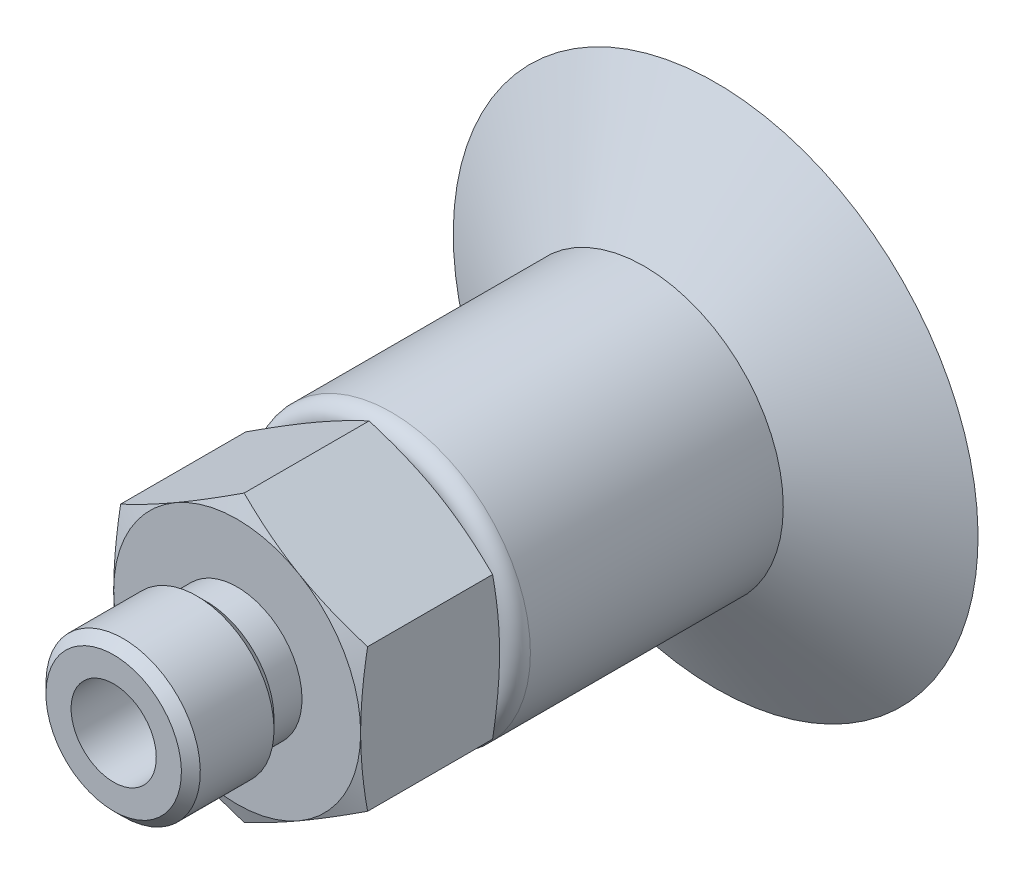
ISO-10303-21;
HEADER;
FILE_DESCRIPTION(('STEP AP214'),'2;1');
FILE_NAME('part.step','',(''),(''),'','','');
FILE_SCHEMA(('AUTOMOTIVE_DESIGN { 1 0 10303 214 1 1 1 1 }'));
ENDSEC;
DATA;
#1=APPLICATION_CONTEXT('core data for automotive mechanical design processes');
#2=APPLICATION_PROTOCOL_DEFINITION('international standard','automotive_design',2000,#1);
#3=PRODUCT_CONTEXT('',#1,'mechanical');
#4=PRODUCT('Part','Part','',(#3));
#5=PRODUCT_RELATED_PRODUCT_CATEGORY('part','',(#4));
#6=PRODUCT_DEFINITION_FORMATION('','',#4);
#7=PRODUCT_DEFINITION_CONTEXT('part definition',#1,'design');
#8=PRODUCT_DEFINITION('design','',#6,#7);
#9=PRODUCT_DEFINITION_SHAPE('','',#8);
#10=(LENGTH_UNIT() NAMED_UNIT(*) SI_UNIT(.MILLI.,.METRE.));
#11=(NAMED_UNIT(*) PLANE_ANGLE_UNIT() SI_UNIT($,.RADIAN.));
#12=(NAMED_UNIT(*) SI_UNIT($,.STERADIAN.) SOLID_ANGLE_UNIT());
#13=UNCERTAINTY_MEASURE_WITH_UNIT(LENGTH_MEASURE(1.E-05),#10,'distance_accuracy_value','');
#14=(GEOMETRIC_REPRESENTATION_CONTEXT(3) GLOBAL_UNCERTAINTY_ASSIGNED_CONTEXT((#13)) GLOBAL_UNIT_ASSIGNED_CONTEXT((#10,
#11,#12)) REPRESENTATION_CONTEXT('',''));
#15=CARTESIAN_POINT('',(0.,0.,0.));
#16=DIRECTION('',(0.,0.,1.));
#17=DIRECTION('',(1.,0.,0.));
#18=AXIS2_PLACEMENT_3D('',#15,#16,#17);
#19=CARTESIAN_POINT('',(4.,2.3094010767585,15.5));
#20=DIRECTION('',(-0.5,-0.866025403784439,0.));
#21=DIRECTION('',(0.,0.,-1.));
#22=AXIS2_PLACEMENT_3D('',#19,#20,#21);
#23=PLANE('',#22);
#24=CARTESIAN_POINT('',(4.,2.3094010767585,11.22522556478));
#25=CARTESIAN_POINT('',(2.92820323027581,2.92820323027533,11.));
#26=CARTESIAN_POINT('',(2.,3.46410161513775,11.));
#27=B_SPLINE_CURVE_WITH_KNOTS('',2,(#24,#25,#26),.UNSPECIFIED.,.F.,.F.,(3,3),(0.,1.),.UNSPECIFIED.);
#28=CARTESIAN_POINT('',(4.,2.3094010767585,11.22522556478));
#29=VERTEX_POINT('',#28);
#30=CARTESIAN_POINT('',(2.,3.46410161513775,11.));
#31=VERTEX_POINT('',#30);
#32=EDGE_CURVE('E599',#29,#31,#27,.T.);
#33=ORIENTED_EDGE('',*,*,#32,.T.);
#34=CARTESIAN_POINT('',(2.,3.46410161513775,11.));
#35=CARTESIAN_POINT('',(1.07179676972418,4.00000000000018,11.));
#36=CARTESIAN_POINT('',(0.,4.618802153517,11.22522556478));
#37=B_SPLINE_CURVE_WITH_KNOTS('',2,(#34,#35,#36),.UNSPECIFIED.,.F.,.F.,(3,3),(0.,1.),.UNSPECIFIED.);
#38=CARTESIAN_POINT('',(0.,4.61880215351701,11.22522556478));
#39=VERTEX_POINT('',#38);
#40=EDGE_CURVE('E650',#31,#39,#37,.T.);
#41=ORIENTED_EDGE('',*,*,#40,.T.);
#42=DIRECTION('',(0.,0.,-1.));
#43=VECTOR('',#42,1.);
#44=CARTESIAN_POINT('',(0.,4.61880215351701,15.5));
#45=LINE('',#44,#43);
#46=CARTESIAN_POINT('',(0.,4.61880215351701,15.27477443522));
#47=VERTEX_POINT('',#46);
#48=EDGE_CURVE('E10',#47,#39,#45,.T.);
#49=ORIENTED_EDGE('',*,*,#48,.F.);
#50=CARTESIAN_POINT('',(0.,4.618802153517,15.27477443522));
#51=CARTESIAN_POINT('',(1.07179676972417,4.00000000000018,15.5));
#52=CARTESIAN_POINT('',(1.99999999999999,3.46410161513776,15.5));
#53=B_SPLINE_CURVE_WITH_KNOTS('',2,(#50,#51,#52),.UNSPECIFIED.,.F.,.F.,(3,3),(0.,1.),.UNSPECIFIED.);
#54=CARTESIAN_POINT('',(2.,3.46410161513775,15.5));
#55=VERTEX_POINT('',#54);
#56=EDGE_CURVE('E86',#47,#55,#53,.T.);
#57=ORIENTED_EDGE('',*,*,#56,.T.);
#58=CARTESIAN_POINT('',(2.,3.46410161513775,15.5));
#59=CARTESIAN_POINT('',(2.92820323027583,2.92820323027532,15.5));
#60=CARTESIAN_POINT('',(4.,2.3094010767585,15.27477443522));
#61=B_SPLINE_CURVE_WITH_KNOTS('',2,(#58,#59,#60),.UNSPECIFIED.,.F.,.F.,(3,3),(0.,1.),.UNSPECIFIED.);
#62=CARTESIAN_POINT('',(4.,2.3094010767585,15.27477443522));
#63=VERTEX_POINT('',#62);
#64=EDGE_CURVE('E789',#55,#63,#61,.T.);
#65=ORIENTED_EDGE('',*,*,#64,.T.);
#66=DIRECTION('',(0.,0.,-1.));
#67=VECTOR('',#66,1.);
#68=CARTESIAN_POINT('',(4.,2.3094010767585,15.5));
#69=LINE('',#68,#67);
#70=EDGE_CURVE('E653',#63,#29,#69,.T.);
#71=ORIENTED_EDGE('',*,*,#70,.T.);
#72=EDGE_LOOP('',(#33,#41,#49,#57,#65,#71));
#73=FACE_BOUND('',#72,.T.);
#74=ADVANCED_FACE('F15',(#73),#23,.F.);
#75=CARTESIAN_POINT('',(0.,4.61880215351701,15.5));
#76=DIRECTION('',(0.5,-0.866025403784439,0.));
#77=DIRECTION('',(0.866025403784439,0.5,0.));
#78=AXIS2_PLACEMENT_3D('',#75,#76,#77);
#79=PLANE('',#78);
#80=CARTESIAN_POINT('',(0.,4.61880215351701,11.22522556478));
#81=CARTESIAN_POINT('',(-1.07179676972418,4.00000000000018,11.));
#82=CARTESIAN_POINT('',(-2.,3.46410161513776,11.));
#83=B_SPLINE_CURVE_WITH_KNOTS('',2,(#80,#81,#82),.UNSPECIFIED.,.F.,.F.,(3,3),(0.,1.),.UNSPECIFIED.);
#84=CARTESIAN_POINT('',(-2.,3.46410161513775,11.));
#85=VERTEX_POINT('',#84);
#86=EDGE_CURVE('E641',#39,#85,#83,.T.);
#87=ORIENTED_EDGE('',*,*,#86,.T.);
#88=CARTESIAN_POINT('',(-2.,3.46410161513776,11.));
#89=CARTESIAN_POINT('',(-2.92820323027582,2.92820323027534,11.));
#90=CARTESIAN_POINT('',(-4.,2.3094010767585,11.22522556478));
#91=B_SPLINE_CURVE_WITH_KNOTS('',2,(#88,#89,#90),.UNSPECIFIED.,.F.,.F.,(3,3),(0.,1.),.UNSPECIFIED.);
#92=CARTESIAN_POINT('',(-4.,2.3094010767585,11.22522556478));
#93=VERTEX_POINT('',#92);
#94=EDGE_CURVE('E412',#85,#93,#91,.T.);
#95=ORIENTED_EDGE('',*,*,#94,.T.);
#96=DIRECTION('',(0.,0.,-1.));
#97=VECTOR('',#96,1.);
#98=CARTESIAN_POINT('',(-4.,2.3094010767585,15.5));
#99=LINE('',#98,#97);
#100=CARTESIAN_POINT('',(-4.,2.3094010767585,15.27477443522));
#101=VERTEX_POINT('',#100);
#102=EDGE_CURVE('E28',#101,#93,#99,.T.);
#103=ORIENTED_EDGE('',*,*,#102,.F.);
#104=CARTESIAN_POINT('',(-4.,2.3094010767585,15.27477443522));
#105=CARTESIAN_POINT('',(-2.92820323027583,2.92820323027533,15.5));
#106=CARTESIAN_POINT('',(-2.,3.46410161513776,15.5));
#107=B_SPLINE_CURVE_WITH_KNOTS('',2,(#104,#105,#106),.UNSPECIFIED.,.F.,.F.,(3,3),(0.,1.),.UNSPECIFIED.);
#108=CARTESIAN_POINT('',(-2.,3.46410161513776,15.5));
#109=VERTEX_POINT('',#108);
#110=EDGE_CURVE('E463',#101,#109,#107,.T.);
#111=ORIENTED_EDGE('',*,*,#110,.T.);
#112=CARTESIAN_POINT('',(-2.,3.46410161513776,15.5));
#113=CARTESIAN_POINT('',(-1.07179676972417,4.00000000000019,15.5));
#114=CARTESIAN_POINT('',(0.,4.61880215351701,15.27477443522));
#115=B_SPLINE_CURVE_WITH_KNOTS('',2,(#112,#113,#114),.UNSPECIFIED.,.F.,.F.,(3,3),(0.,1.),.UNSPECIFIED.);
#116=EDGE_CURVE('E796',#109,#47,#115,.T.);
#117=ORIENTED_EDGE('',*,*,#116,.T.);
#118=ORIENTED_EDGE('',*,*,#48,.T.);
#119=EDGE_LOOP('',(#87,#95,#103,#111,#117,#118));
#120=FACE_BOUND('',#119,.T.);
#121=ADVANCED_FACE('F419',(#120),#79,.F.);
#122=CARTESIAN_POINT('',(-4.,2.3094010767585,15.5));
#123=DIRECTION('',(1.,0.,0.));
#124=DIRECTION('',(0.,1.,0.));
#125=AXIS2_PLACEMENT_3D('',#122,#123,#124);
#126=PLANE('',#125);
#127=CARTESIAN_POINT('',(-4.,2.3094010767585,11.22522556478));
#128=CARTESIAN_POINT('',(-4.,1.07179676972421,11.));
#129=CARTESIAN_POINT('',(-4.,0.,11.));
#130=B_SPLINE_CURVE_WITH_KNOTS('',2,(#127,#128,#129),.UNSPECIFIED.,.F.,.F.,(3,3),(0.,1.),.UNSPECIFIED.);
#131=CARTESIAN_POINT('',(-4.,0.,11.));
#132=VERTEX_POINT('',#131);
#133=EDGE_CURVE('E398',#93,#132,#130,.T.);
#134=ORIENTED_EDGE('',*,*,#133,.T.);
#135=CARTESIAN_POINT('',(-4.,0.,11.));
#136=CARTESIAN_POINT('',(-4.,-1.07179676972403,11.));
#137=CARTESIAN_POINT('',(-4.,-2.3094010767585,11.22522556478));
#138=B_SPLINE_CURVE_WITH_KNOTS('',2,(#135,#136,#137),.UNSPECIFIED.,.F.,.F.,(3,3),(0.,1.),.UNSPECIFIED.);
#139=CARTESIAN_POINT('',(-4.,-2.3094010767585,11.22522556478));
#140=VERTEX_POINT('',#139);
#141=EDGE_CURVE('E554',#132,#140,#138,.T.);
#142=ORIENTED_EDGE('',*,*,#141,.T.);
#143=DIRECTION('',(0.,0.,-1.));
#144=VECTOR('',#143,1.);
#145=CARTESIAN_POINT('',(-4.,-2.3094010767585,15.5));
#146=LINE('',#145,#144);
#147=CARTESIAN_POINT('',(-4.,-2.3094010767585,15.27477443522));
#148=VERTEX_POINT('',#147);
#149=EDGE_CURVE('E211',#148,#140,#146,.T.);
#150=ORIENTED_EDGE('',*,*,#149,.F.);
#151=CARTESIAN_POINT('',(-4.,-2.3094010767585,15.27477443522));
#152=CARTESIAN_POINT('',(-4.,-1.0717967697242,15.5));
#153=CARTESIAN_POINT('',(-4.,0.,15.5));
#154=B_SPLINE_CURVE_WITH_KNOTS('',2,(#151,#152,#153),.UNSPECIFIED.,.F.,.F.,(3,3),(0.,1.),.UNSPECIFIED.);
#155=CARTESIAN_POINT('',(-4.,0.,15.5));
#156=VERTEX_POINT('',#155);
#157=EDGE_CURVE('E500',#148,#156,#154,.T.);
#158=ORIENTED_EDGE('',*,*,#157,.T.);
#159=CARTESIAN_POINT('',(-4.,0.,15.5));
#160=CARTESIAN_POINT('',(-4.,1.07179676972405,15.5));
#161=CARTESIAN_POINT('',(-4.,2.3094010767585,15.27477443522));
#162=B_SPLINE_CURVE_WITH_KNOTS('',2,(#159,#160,#161),.UNSPECIFIED.,.F.,.F.,(3,3),(0.,1.),.UNSPECIFIED.);
#163=EDGE_CURVE('E703',#156,#101,#162,.T.);
#164=ORIENTED_EDGE('',*,*,#163,.T.);
#165=ORIENTED_EDGE('',*,*,#102,.T.);
#166=EDGE_LOOP('',(#134,#142,#150,#158,#164,#165));
#167=FACE_BOUND('',#166,.T.);
#168=ADVANCED_FACE('F248',(#167),#126,.F.);
#169=CARTESIAN_POINT('',(-4.,-2.3094010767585,15.5));
#170=DIRECTION('',(0.5,0.866025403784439,0.));
#171=DIRECTION('',(0.,0.,1.));
#172=AXIS2_PLACEMENT_3D('',#169,#170,#171);
#173=PLANE('',#172);
#174=CARTESIAN_POINT('',(-4.,-2.3094010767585,11.22522556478));
#175=CARTESIAN_POINT('',(-2.92820323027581,-2.92820323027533,11.));
#176=CARTESIAN_POINT('',(-2.,-3.46410161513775,11.));
#177=B_SPLINE_CURVE_WITH_KNOTS('',2,(#174,#175,#176),.UNSPECIFIED.,.F.,.F.,(3,3),(0.,1.),.UNSPECIFIED.);
#178=CARTESIAN_POINT('',(-2.,-3.46410161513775,11.));
#179=VERTEX_POINT('',#178);
#180=EDGE_CURVE('E229',#140,#179,#177,.T.);
#181=ORIENTED_EDGE('',*,*,#180,.T.);
#182=CARTESIAN_POINT('',(-2.,-3.46410161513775,11.));
#183=CARTESIAN_POINT('',(-1.07179676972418,-4.00000000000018,11.));
#184=CARTESIAN_POINT('',(0.,-4.618802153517,11.22522556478));
#185=B_SPLINE_CURVE_WITH_KNOTS('',2,(#182,#183,#184),.UNSPECIFIED.,.F.,.F.,(3,3),(0.,1.),.UNSPECIFIED.);
#186=CARTESIAN_POINT('',(0.,-4.61880215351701,11.22522556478));
#187=VERTEX_POINT('',#186);
#188=EDGE_CURVE('E217',#179,#187,#185,.T.);
#189=ORIENTED_EDGE('',*,*,#188,.T.);
#190=DIRECTION('',(0.,0.,-1.));
#191=VECTOR('',#190,1.);
#192=CARTESIAN_POINT('',(0.,-4.61880215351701,15.5));
#193=LINE('',#192,#191);
#194=CARTESIAN_POINT('',(0.,-4.61880215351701,15.27477443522));
#195=VERTEX_POINT('',#194);
#196=EDGE_CURVE('E197',#195,#187,#193,.T.);
#197=ORIENTED_EDGE('',*,*,#196,.F.);
#198=CARTESIAN_POINT('',(0.,-4.618802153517,15.27477443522));
#199=CARTESIAN_POINT('',(-1.07179676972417,-4.00000000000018,15.5));
#200=CARTESIAN_POINT('',(-2.,-3.46410161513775,15.5));
#201=B_SPLINE_CURVE_WITH_KNOTS('',2,(#198,#199,#200),.UNSPECIFIED.,.F.,.F.,(3,3),(0.,1.),.UNSPECIFIED.);
#202=CARTESIAN_POINT('',(-2.,-3.46410161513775,15.5));
#203=VERTEX_POINT('',#202);
#204=EDGE_CURVE('E275',#195,#203,#201,.T.);
#205=ORIENTED_EDGE('',*,*,#204,.T.);
#206=CARTESIAN_POINT('',(-2.,-3.46410161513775,15.5));
#207=CARTESIAN_POINT('',(-2.92820323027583,-2.92820323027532,15.5));
#208=CARTESIAN_POINT('',(-4.,-2.3094010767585,15.27477443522));
#209=B_SPLINE_CURVE_WITH_KNOTS('',2,(#206,#207,#208),.UNSPECIFIED.,.F.,.F.,(3,3),(0.,1.),.UNSPECIFIED.);
#210=EDGE_CURVE('E501',#203,#148,#209,.T.);
#211=ORIENTED_EDGE('',*,*,#210,.T.);
#212=ORIENTED_EDGE('',*,*,#149,.T.);
#213=EDGE_LOOP('',(#181,#189,#197,#205,#211,#212));
#214=FACE_BOUND('',#213,.T.);
#215=ADVANCED_FACE('F227',(#214),#173,.F.);
#216=CARTESIAN_POINT('',(0.,-4.61880215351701,15.5));
#217=DIRECTION('',(-0.5,0.866025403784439,0.));
#218=DIRECTION('',(0.,0.,-1.));
#219=AXIS2_PLACEMENT_3D('',#216,#217,#218);
#220=PLANE('',#219);
#221=CARTESIAN_POINT('',(0.,-4.61880215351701,11.22522556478));
#222=CARTESIAN_POINT('',(1.07179676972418,-4.00000000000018,11.));
#223=CARTESIAN_POINT('',(2.,-3.46410161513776,11.));
#224=B_SPLINE_CURVE_WITH_KNOTS('',2,(#221,#222,#223),.UNSPECIFIED.,.F.,.F.,(3,3),(0.,1.),.UNSPECIFIED.);
#225=CARTESIAN_POINT('',(2.,-3.46410161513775,11.));
#226=VERTEX_POINT('',#225);
#227=EDGE_CURVE('E200',#187,#226,#224,.T.);
#228=ORIENTED_EDGE('',*,*,#227,.T.);
#229=CARTESIAN_POINT('',(2.,-3.46410161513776,11.));
#230=CARTESIAN_POINT('',(2.92820323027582,-2.92820323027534,11.));
#231=CARTESIAN_POINT('',(4.,-2.3094010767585,11.22522556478));
#232=B_SPLINE_CURVE_WITH_KNOTS('',2,(#229,#230,#231),.UNSPECIFIED.,.F.,.F.,(3,3),(0.,1.),.UNSPECIFIED.);
#233=CARTESIAN_POINT('',(4.,-2.3094010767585,11.22522556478));
#234=VERTEX_POINT('',#233);
#235=EDGE_CURVE('E222',#226,#234,#232,.T.);
#236=ORIENTED_EDGE('',*,*,#235,.T.);
#237=DIRECTION('',(0.,0.,-1.));
#238=VECTOR('',#237,1.);
#239=CARTESIAN_POINT('',(4.,-2.3094010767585,15.5));
#240=LINE('',#239,#238);
#241=CARTESIAN_POINT('',(4.,-2.3094010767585,15.27477443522));
#242=VERTEX_POINT('',#241);
#243=EDGE_CURVE('E71',#242,#234,#240,.T.);
#244=ORIENTED_EDGE('',*,*,#243,.F.);
#245=CARTESIAN_POINT('',(4.,-2.3094010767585,15.27477443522));
#246=CARTESIAN_POINT('',(2.92820323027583,-2.92820323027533,15.5));
#247=CARTESIAN_POINT('',(2.,-3.46410161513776,15.5));
#248=B_SPLINE_CURVE_WITH_KNOTS('',2,(#245,#246,#247),.UNSPECIFIED.,.F.,.F.,(3,3),(0.,1.),.UNSPECIFIED.);
#249=CARTESIAN_POINT('',(2.,-3.46410161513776,15.5));
#250=VERTEX_POINT('',#249);
#251=EDGE_CURVE('E313',#242,#250,#248,.T.);
#252=ORIENTED_EDGE('',*,*,#251,.T.);
#253=CARTESIAN_POINT('',(2.,-3.46410161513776,15.5));
#254=CARTESIAN_POINT('',(1.07179676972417,-4.00000000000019,15.5));
#255=CARTESIAN_POINT('',(0.,-4.61880215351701,15.27477443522));
#256=B_SPLINE_CURVE_WITH_KNOTS('',2,(#253,#254,#255),.UNSPECIFIED.,.F.,.F.,(3,3),(0.,1.),.UNSPECIFIED.);
#257=EDGE_CURVE('E204',#250,#195,#256,.T.);
#258=ORIENTED_EDGE('',*,*,#257,.T.);
#259=ORIENTED_EDGE('',*,*,#196,.T.);
#260=EDGE_LOOP('',(#228,#236,#244,#252,#258,#259));
#261=FACE_BOUND('',#260,.T.);
#262=ADVANCED_FACE('F199',(#261),#220,.F.);
#263=CARTESIAN_POINT('',(4.,-2.3094010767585,15.5));
#264=DIRECTION('',(-1.,0.,0.));
#265=DIRECTION('',(0.,0.,1.));
#266=AXIS2_PLACEMENT_3D('',#263,#264,#265);
#267=PLANE('',#266);
#268=CARTESIAN_POINT('',(4.,-2.3094010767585,11.22522556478));
#269=CARTESIAN_POINT('',(4.,-1.07179676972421,11.));
#270=CARTESIAN_POINT('',(4.,0.,11.));
#271=B_SPLINE_CURVE_WITH_KNOTS('',2,(#268,#269,#270),.UNSPECIFIED.,.F.,.F.,(3,3),(0.,1.),.UNSPECIFIED.);
#272=CARTESIAN_POINT('',(4.,0.,11.));
#273=VERTEX_POINT('',#272);
#274=EDGE_CURVE('E391',#234,#273,#271,.T.);
#275=ORIENTED_EDGE('',*,*,#274,.T.);
#276=CARTESIAN_POINT('',(4.,0.,11.));
#277=CARTESIAN_POINT('',(4.,1.07179676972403,11.));
#278=CARTESIAN_POINT('',(4.,2.3094010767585,11.22522556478));
#279=B_SPLINE_CURVE_WITH_KNOTS('',2,(#276,#277,#278),.UNSPECIFIED.,.F.,.F.,(3,3),(0.,1.),.UNSPECIFIED.);
#280=EDGE_CURVE('E596',#273,#29,#279,.T.);
#281=ORIENTED_EDGE('',*,*,#280,.T.);
#282=ORIENTED_EDGE('',*,*,#70,.F.);
#283=CARTESIAN_POINT('',(4.,2.3094010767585,15.27477443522));
#284=CARTESIAN_POINT('',(4.,1.0717967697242,15.5));
#285=CARTESIAN_POINT('',(4.,0.,15.5));
#286=B_SPLINE_CURVE_WITH_KNOTS('',2,(#283,#284,#285),.UNSPECIFIED.,.F.,.F.,(3,3),(0.,1.),.UNSPECIFIED.);
#287=CARTESIAN_POINT('',(4.,0.,15.5));
#288=VERTEX_POINT('',#287);
#289=EDGE_CURVE('E655',#63,#288,#286,.T.);
#290=ORIENTED_EDGE('',*,*,#289,.T.);
#291=CARTESIAN_POINT('',(4.,0.,15.5));
#292=CARTESIAN_POINT('',(4.,-1.07179676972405,15.5));
#293=CARTESIAN_POINT('',(4.,-2.3094010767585,15.27477443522));
#294=B_SPLINE_CURVE_WITH_KNOTS('',2,(#291,#292,#293),.UNSPECIFIED.,.F.,.F.,(3,3),(0.,1.),.UNSPECIFIED.);
#295=EDGE_CURVE('E314',#288,#242,#294,.T.);
#296=ORIENTED_EDGE('',*,*,#295,.T.);
#297=ORIENTED_EDGE('',*,*,#243,.T.);
#298=EDGE_LOOP('',(#275,#281,#282,#290,#296,#297));
#299=FACE_BOUND('',#298,.T.);
#300=ADVANCED_FACE('F332',(#299),#267,.F.);
#301=CARTESIAN_POINT('',(-2.1935,0.,19.5));
#302=DIRECTION('',(0.,0.,1.));
#303=DIRECTION('',(-1.,0.,0.));
#304=AXIS2_PLACEMENT_3D('',#301,#302,#303);
#305=PLANE('',#304);
#306=CARTESIAN_POINT('',(0.,0.,19.5));
#307=DIRECTION('',(0.,0.,-1.));
#308=DIRECTION('',(0.,-1.,0.));
#309=AXIS2_PLACEMENT_3D('',#306,#307,#308);
#310=CIRCLE('',#309,2.1935);
#311=CARTESIAN_POINT('',(0.,-2.1935,19.5));
#312=VERTEX_POINT('',#311);
#313=EDGE_CURVE('E39',#312,#312,#310,.T.);
#314=ORIENTED_EDGE('',*,*,#313,.F.);
#315=EDGE_LOOP('',(#314));
#316=FACE_BOUND('',#315,.T.);
#317=CARTESIAN_POINT('',(0.,0.,19.5));
#318=DIRECTION('',(0.,0.,-1.));
#319=DIRECTION('',(0.,-1.,0.));
#320=AXIS2_PLACEMENT_3D('',#317,#318,#319);
#321=CIRCLE('',#320,1.38);
#322=CARTESIAN_POINT('',(0.,-1.38,19.5));
#323=VERTEX_POINT('',#322);
#324=EDGE_CURVE('E740',#323,#323,#321,.T.);
#325=ORIENTED_EDGE('',*,*,#324,.T.);
#326=EDGE_LOOP('',(#325));
#327=FACE_BOUND('',#326,.T.);
#328=ADVANCED_FACE('F570',(#316,#327),#305,.T.);
#329=CARTESIAN_POINT('',(0.,0.,19.1935));
#330=DIRECTION('',(0.,0.,-1.));
#331=DIRECTION('',(0.,-1.,0.));
#332=AXIS2_PLACEMENT_3D('',#329,#330,#331);
#333=CONICAL_SURFACE('',#332,2.5,0.785398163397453);
#334=CARTESIAN_POINT('',(0.,0.,19.1935));
#335=DIRECTION('',(0.,0.,-1.));
#336=DIRECTION('',(0.,-1.,0.));
#337=AXIS2_PLACEMENT_3D('',#334,#335,#336);
#338=CIRCLE('',#337,2.5);
#339=CARTESIAN_POINT('',(0.,-2.5,19.1935));
#340=VERTEX_POINT('',#339);
#341=EDGE_CURVE('E49',#340,#340,#338,.T.);
#342=ORIENTED_EDGE('',*,*,#341,.F.);
#343=EDGE_LOOP('',(#342));
#344=FACE_BOUND('',#343,.T.);
#345=ORIENTED_EDGE('',*,*,#313,.T.);
#346=EDGE_LOOP('',(#345));
#347=FACE_BOUND('',#346,.T.);
#348=ADVANCED_FACE('F837',(#344,#347),#333,.T.);
#349=CARTESIAN_POINT('',(0.,0.,0.));
#350=DIRECTION('',(0.,0.,-1.));
#351=DIRECTION('',(0.,-1.,0.));
#352=AXIS2_PLACEMENT_3D('',#349,#350,#351);
#353=CYLINDRICAL_SURFACE('',#352,2.5);
#354=CARTESIAN_POINT('',(0.,0.,16.8065));
#355=DIRECTION('',(0.,0.,-1.));
#356=DIRECTION('',(0.,-1.,0.));
#357=AXIS2_PLACEMENT_3D('',#354,#355,#356);
#358=CIRCLE('',#357,2.5);
#359=CARTESIAN_POINT('',(0.,-2.5,16.8065));
#360=VERTEX_POINT('',#359);
#361=EDGE_CURVE('E1286',#360,#360,#358,.T.);
#362=ORIENTED_EDGE('',*,*,#361,.F.);
#363=EDGE_LOOP('',(#362));
#364=FACE_BOUND('',#363,.T.);
#365=ORIENTED_EDGE('',*,*,#341,.T.);
#366=EDGE_LOOP('',(#365));
#367=FACE_BOUND('',#366,.T.);
#368=ADVANCED_FACE('F333',(#364,#367),#353,.T.);
#369=CARTESIAN_POINT('',(0.,0.,16.5));
#370=DIRECTION('',(0.,0.,1.));
#371=DIRECTION('',(0.,1.,0.));
#372=AXIS2_PLACEMENT_3D('',#369,#370,#371);
#373=CONICAL_SURFACE('',#372,2.1935,0.785398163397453);
#374=CARTESIAN_POINT('',(0.,0.,16.5));
#375=DIRECTION('',(0.,0.,-1.));
#376=DIRECTION('',(0.,-1.,0.));
#377=AXIS2_PLACEMENT_3D('',#374,#375,#376);
#378=CIRCLE('',#377,2.1935);
#379=CARTESIAN_POINT('',(0.,-2.1935,16.5));
#380=VERTEX_POINT('',#379);
#381=EDGE_CURVE('E730',#380,#380,#378,.T.);
#382=ORIENTED_EDGE('',*,*,#381,.F.);
#383=EDGE_LOOP('',(#382));
#384=FACE_BOUND('',#383,.T.);
#385=ORIENTED_EDGE('',*,*,#361,.T.);
#386=EDGE_LOOP('',(#385));
#387=FACE_BOUND('',#386,.T.);
#388=ADVANCED_FACE('F523',(#384,#387),#373,.T.);
#389=CARTESIAN_POINT('',(-2.1,0.,16.5));
#390=DIRECTION('',(0.,0.,-1.));
#391=DIRECTION('',(0.,-1.,0.));
#392=AXIS2_PLACEMENT_3D('',#389,#390,#391);
#393=PLANE('',#392);
#394=CARTESIAN_POINT('',(0.,0.,16.5));
#395=DIRECTION('',(0.,0.,-1.));
#396=DIRECTION('',(0.,-1.,0.));
#397=AXIS2_PLACEMENT_3D('',#394,#395,#396);
#398=CIRCLE('',#397,2.1);
#399=CARTESIAN_POINT('',(0.,-2.1,16.5));
#400=VERTEX_POINT('',#399);
#401=EDGE_CURVE('E727',#400,#400,#398,.T.);
#402=ORIENTED_EDGE('',*,*,#401,.F.);
#403=EDGE_LOOP('',(#402));
#404=FACE_BOUND('',#403,.T.);
#405=ORIENTED_EDGE('',*,*,#381,.T.);
#406=EDGE_LOOP('',(#405));
#407=FACE_BOUND('',#406,.T.);
#408=ADVANCED_FACE('F522',(#404,#407),#393,.T.);
#409=CARTESIAN_POINT('',(0.,0.,0.));
#410=DIRECTION('',(0.,0.,-1.));
#411=DIRECTION('',(0.,-1.,0.));
#412=AXIS2_PLACEMENT_3D('',#409,#410,#411);
#413=CYLINDRICAL_SURFACE('',#412,2.1);
#414=CARTESIAN_POINT('',(0.,0.,15.5));
#415=DIRECTION('',(0.,0.,-1.));
#416=DIRECTION('',(0.,-1.,0.));
#417=AXIS2_PLACEMENT_3D('',#414,#415,#416);
#418=CIRCLE('',#417,2.1);
#419=CARTESIAN_POINT('',(0.,-2.1,15.5));
#420=VERTEX_POINT('',#419);
#421=EDGE_CURVE('E731',#420,#420,#418,.T.);
#422=ORIENTED_EDGE('',*,*,#421,.F.);
#423=EDGE_LOOP('',(#422));
#424=FACE_BOUND('',#423,.T.);
#425=ORIENTED_EDGE('',*,*,#401,.T.);
#426=EDGE_LOOP('',(#425));
#427=FACE_BOUND('',#426,.T.);
#428=ADVANCED_FACE('F429',(#424,#427),#413,.T.);
#429=CARTESIAN_POINT('',(-4.,0.,15.5));
#430=DIRECTION('',(0.,0.,1.));
#431=DIRECTION('',(-1.,0.,0.));
#432=AXIS2_PLACEMENT_3D('',#429,#430,#431);
#433=PLANE('',#432);
#434=CARTESIAN_POINT('',(0.,0.,15.5));
#435=DIRECTION('',(0.,0.,-1.));
#436=DIRECTION('',(0.,-1.,0.));
#437=AXIS2_PLACEMENT_3D('',#434,#435,#436);
#438=CIRCLE('',#437,4.);
#439=EDGE_CURVE('E695',#156,#109,#438,.T.);
#440=ORIENTED_EDGE('',*,*,#439,.F.);
#441=CARTESIAN_POINT('',(0.,0.,15.5));
#442=DIRECTION('',(0.,0.,-1.));
#443=DIRECTION('',(0.,-1.,0.));
#444=AXIS2_PLACEMENT_3D('',#441,#442,#443);
#445=CIRCLE('',#444,4.);
#446=EDGE_CURVE('E491',#203,#156,#445,.T.);
#447=ORIENTED_EDGE('',*,*,#446,.F.);
#448=CARTESIAN_POINT('',(0.,0.,15.5));
#449=DIRECTION('',(0.,0.,-1.));
#450=DIRECTION('',(0.,-1.,0.));
#451=AXIS2_PLACEMENT_3D('',#448,#449,#450);
#452=CIRCLE('',#451,4.);
#453=EDGE_CURVE('E799',#250,#203,#452,.T.);
#454=ORIENTED_EDGE('',*,*,#453,.F.);
#455=CARTESIAN_POINT('',(0.,0.,15.5));
#456=DIRECTION('',(0.,0.,-1.));
#457=DIRECTION('',(0.,-1.,0.));
#458=AXIS2_PLACEMENT_3D('',#455,#456,#457);
#459=CIRCLE('',#458,4.);
#460=EDGE_CURVE('E304',#288,#250,#459,.T.);
#461=ORIENTED_EDGE('',*,*,#460,.F.);
#462=CARTESIAN_POINT('',(0.,0.,15.5));
#463=DIRECTION('',(0.,0.,-1.));
#464=DIRECTION('',(0.,-1.,0.));
#465=AXIS2_PLACEMENT_3D('',#462,#463,#464);
#466=CIRCLE('',#465,4.);
#467=EDGE_CURVE('E1241',#55,#288,#466,.T.);
#468=ORIENTED_EDGE('',*,*,#467,.F.);
#469=CARTESIAN_POINT('',(0.,0.,15.5));
#470=DIRECTION('',(0.,0.,-1.));
#471=DIRECTION('',(0.,-1.,0.));
#472=AXIS2_PLACEMENT_3D('',#469,#470,#471);
#473=CIRCLE('',#472,4.);
#474=EDGE_CURVE('E777',#109,#55,#473,.T.);
#475=ORIENTED_EDGE('',*,*,#474,.F.);
#476=EDGE_LOOP('',(#440,#447,#454,#461,#468,#475));
#477=FACE_BOUND('',#476,.T.);
#478=ORIENTED_EDGE('',*,*,#421,.T.);
#479=EDGE_LOOP('',(#478));
#480=FACE_BOUND('',#479,.T.);
#481=ADVANCED_FACE('F335',(#477,#480),#433,.T.);
#482=CARTESIAN_POINT('',(0.,0.,15.0147063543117));
#483=DIRECTION('',(0.,0.,-1.));
#484=DIRECTION('',(0.,-1.,0.));
#485=AXIS2_PLACEMENT_3D('',#482,#483,#484);
#486=CONICAL_SURFACE('',#485,5.33333333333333,1.22173047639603);
#487=ORIENTED_EDGE('',*,*,#116,.F.);
#488=ORIENTED_EDGE('',*,*,#474,.T.);
#489=ORIENTED_EDGE('',*,*,#56,.F.);
#490=EDGE_LOOP('',(#487,#488,#489));
#491=FACE_BOUND('',#490,.T.);
#492=ADVANCED_FACE('F623',(#491),#486,.T.);
#493=CARTESIAN_POINT('',(0.,0.,11.));
#494=DIRECTION('',(0.,0.,1.));
#495=DIRECTION('',(0.,1.,0.));
#496=AXIS2_PLACEMENT_3D('',#493,#494,#495);
#497=CONICAL_SURFACE('',#496,4.,1.22173047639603);
#498=ORIENTED_EDGE('',*,*,#86,.F.);
#499=ORIENTED_EDGE('',*,*,#40,.F.);
#500=CARTESIAN_POINT('',(0.,0.,11.));
#501=DIRECTION('',(0.,0.,-1.));
#502=DIRECTION('',(0.,-1.,0.));
#503=AXIS2_PLACEMENT_3D('',#500,#501,#502);
#504=CIRCLE('',#503,4.);
#505=EDGE_CURVE('E633',#85,#31,#504,.T.);
#506=ORIENTED_EDGE('',*,*,#505,.F.);
#507=EDGE_LOOP('',(#498,#499,#506));
#508=FACE_BOUND('',#507,.T.);
#509=ADVANCED_FACE('F615',(#508),#497,.T.);
#510=CARTESIAN_POINT('',(0.,0.,10.5));
#511=DIRECTION('',(0.,0.,-1.));
#512=DIRECTION('',(0.,-1.,0.));
#513=AXIS2_PLACEMENT_3D('',#510,#511,#512);
#514=TOROIDAL_SURFACE('',#513,4.,0.5);
#515=CARTESIAN_POINT('',(0.,0.,10.5));
#516=DIRECTION('',(0.,0.,-1.));
#517=DIRECTION('',(0.,-1.,0.));
#518=AXIS2_PLACEMENT_3D('',#515,#516,#517);
#519=CIRCLE('',#518,4.5);
#520=CARTESIAN_POINT('',(0.,-4.5,10.5));
#521=VERTEX_POINT('',#520);
#522=EDGE_CURVE('E642',#521,#521,#519,.T.);
#523=ORIENTED_EDGE('',*,*,#522,.F.);
#524=EDGE_LOOP('',(#523));
#525=FACE_BOUND('',#524,.T.);
#526=CARTESIAN_POINT('',(0.,0.,11.));
#527=DIRECTION('',(0.,0.,-1.));
#528=DIRECTION('',(0.,-1.,0.));
#529=AXIS2_PLACEMENT_3D('',#526,#527,#528);
#530=CIRCLE('',#529,4.);
#531=EDGE_CURVE('E232',#179,#132,#530,.T.);
#532=ORIENTED_EDGE('',*,*,#531,.T.);
#533=CARTESIAN_POINT('',(0.,0.,11.));
#534=DIRECTION('',(0.,0.,-1.));
#535=DIRECTION('',(0.,-1.,0.));
#536=AXIS2_PLACEMENT_3D('',#533,#534,#535);
#537=CIRCLE('',#536,4.);
#538=EDGE_CURVE('E601',#132,#85,#537,.T.);
#539=ORIENTED_EDGE('',*,*,#538,.T.);
#540=ORIENTED_EDGE('',*,*,#505,.T.);
#541=CARTESIAN_POINT('',(0.,0.,11.));
#542=DIRECTION('',(0.,0.,-1.));
#543=DIRECTION('',(0.,-1.,0.));
#544=AXIS2_PLACEMENT_3D('',#541,#542,#543);
#545=CIRCLE('',#544,4.);
#546=EDGE_CURVE('E388',#31,#273,#545,.T.);
#547=ORIENTED_EDGE('',*,*,#546,.T.);
#548=CARTESIAN_POINT('',(0.,0.,11.));
#549=DIRECTION('',(0.,0.,-1.));
#550=DIRECTION('',(0.,-1.,0.));
#551=AXIS2_PLACEMENT_3D('',#548,#549,#550);
#552=CIRCLE('',#551,4.);
#553=EDGE_CURVE('E385',#273,#226,#552,.T.);
#554=ORIENTED_EDGE('',*,*,#553,.T.);
#555=CARTESIAN_POINT('',(0.,0.,11.));
#556=DIRECTION('',(0.,0.,-1.));
#557=DIRECTION('',(0.,-1.,0.));
#558=AXIS2_PLACEMENT_3D('',#555,#556,#557);
#559=CIRCLE('',#558,4.);
#560=EDGE_CURVE('E220',#226,#179,#559,.T.);
#561=ORIENTED_EDGE('',*,*,#560,.T.);
#562=EDGE_LOOP('',(#532,#539,#540,#547,#554,#561));
#563=FACE_BOUND('',#562,.T.);
#564=ADVANCED_FACE('F382',(#525,#563),#514,.T.);
#565=CARTESIAN_POINT('',(0.,0.,0.));
#566=DIRECTION('',(0.,0.,-1.));
#567=DIRECTION('',(0.,-1.,0.));
#568=AXIS2_PLACEMENT_3D('',#565,#566,#567);
#569=CYLINDRICAL_SURFACE('',#568,4.5);
#570=CARTESIAN_POINT('',(0.,0.,2.3094010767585));
#571=DIRECTION('',(0.,0.,-1.));
#572=DIRECTION('',(0.,-1.,0.));
#573=AXIS2_PLACEMENT_3D('',#570,#571,#572);
#574=CIRCLE('',#573,4.5);
#575=CARTESIAN_POINT('',(0.,-4.5,2.3094010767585));
#576=VERTEX_POINT('',#575);
#577=EDGE_CURVE('E1308',#576,#576,#574,.T.);
#578=ORIENTED_EDGE('',*,*,#577,.F.);
#579=EDGE_LOOP('',(#578));
#580=FACE_BOUND('',#579,.T.);
#581=ORIENTED_EDGE('',*,*,#522,.T.);
#582=EDGE_LOOP('',(#581));
#583=FACE_BOUND('',#582,.T.);
#584=ADVANCED_FACE('F680',(#580,#583),#569,.T.);
#585=CARTESIAN_POINT('',(0.,0.,0.));
#586=DIRECTION('',(0.,0.,-1.));
#587=DIRECTION('',(0.,-1.,0.));
#588=AXIS2_PLACEMENT_3D('',#585,#586,#587);
#589=CONICAL_SURFACE('',#588,8.5,1.0471975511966);
#590=CARTESIAN_POINT('',(0.,0.,0.));
#591=DIRECTION('',(0.,0.,-1.));
#592=DIRECTION('',(0.,-1.,0.));
#593=AXIS2_PLACEMENT_3D('',#590,#591,#592);
#594=CIRCLE('',#593,8.5);
#595=CARTESIAN_POINT('',(0.,-8.5,0.));
#596=VERTEX_POINT('',#595);
#597=EDGE_CURVE('E739',#596,#596,#594,.T.);
#598=ORIENTED_EDGE('',*,*,#597,.F.);
#599=EDGE_LOOP('',(#598));
#600=FACE_BOUND('',#599,.T.);
#601=ORIENTED_EDGE('',*,*,#577,.T.);
#602=EDGE_LOOP('',(#601));
#603=FACE_BOUND('',#602,.T.);
#604=ADVANCED_FACE('F827',(#600,#603),#589,.T.);
#605=CARTESIAN_POINT('',(-8.25,0.,0.));
#606=DIRECTION('',(0.,0.,-1.));
#607=DIRECTION('',(0.,-1.,0.));
#608=AXIS2_PLACEMENT_3D('',#605,#606,#607);
#609=PLANE('',#608);
#610=CARTESIAN_POINT('',(0.,0.,0.));
#611=DIRECTION('',(0.,0.,-1.));
#612=DIRECTION('',(0.,-1.,0.));
#613=AXIS2_PLACEMENT_3D('',#610,#611,#612);
#614=CIRCLE('',#613,8.25);
#615=CARTESIAN_POINT('',(0.,-8.25,0.));
#616=VERTEX_POINT('',#615);
#617=EDGE_CURVE('E736',#616,#616,#614,.T.);
#618=ORIENTED_EDGE('',*,*,#617,.F.);
#619=EDGE_LOOP('',(#618));
#620=FACE_BOUND('',#619,.T.);
#621=ORIENTED_EDGE('',*,*,#597,.T.);
#622=EDGE_LOOP('',(#621));
#623=FACE_BOUND('',#622,.T.);
#624=ADVANCED_FACE('F894',(#620,#623),#609,.T.);
#625=CARTESIAN_POINT('',(0.,0.,2.3));
#626=DIRECTION('',(0.,0.,-1.));
#627=DIRECTION('',(0.,-1.,0.));
#628=AXIS2_PLACEMENT_3D('',#625,#626,#627);
#629=CONICAL_SURFACE('',#628,1.38,1.24773630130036);
#630=CARTESIAN_POINT('',(0.,0.,2.3));
#631=DIRECTION('',(0.,0.,-1.));
#632=DIRECTION('',(0.,-1.,0.));
#633=AXIS2_PLACEMENT_3D('',#630,#631,#632);
#634=CIRCLE('',#633,1.38);
#635=CARTESIAN_POINT('',(0.,-1.38,2.3));
#636=VERTEX_POINT('',#635);
#637=EDGE_CURVE('E715',#636,#636,#634,.T.);
#638=ORIENTED_EDGE('',*,*,#637,.F.);
#639=EDGE_LOOP('',(#638));
#640=FACE_BOUND('',#639,.T.);
#641=ORIENTED_EDGE('',*,*,#617,.T.);
#642=EDGE_LOOP('',(#641));
#643=FACE_BOUND('',#642,.T.);
#644=ADVANCED_FACE('F677',(#640,#643),#629,.F.);
#645=CARTESIAN_POINT('',(0.,0.,0.));
#646=DIRECTION('',(0.,0.,-1.));
#647=DIRECTION('',(0.,-1.,0.));
#648=AXIS2_PLACEMENT_3D('',#645,#646,#647);
#649=CYLINDRICAL_SURFACE('',#648,1.38);
#650=ORIENTED_EDGE('',*,*,#324,.F.);
#651=EDGE_LOOP('',(#650));
#652=FACE_BOUND('',#651,.T.);
#653=ORIENTED_EDGE('',*,*,#637,.T.);
#654=EDGE_LOOP('',(#653));
#655=FACE_BOUND('',#654,.T.);
#656=ADVANCED_FACE('F480',(#652,#655),#649,.F.);
#657=CARTESIAN_POINT('',(0.,0.,15.0147063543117));
#658=DIRECTION('',(0.,0.,-1.));
#659=DIRECTION('',(0.,-1.,0.));
#660=AXIS2_PLACEMENT_3D('',#657,#658,#659);
#661=CONICAL_SURFACE('',#660,5.33333333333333,1.22173047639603);
#662=ORIENTED_EDGE('',*,*,#163,.F.);
#663=ORIENTED_EDGE('',*,*,#439,.T.);
#664=ORIENTED_EDGE('',*,*,#110,.F.);
#665=EDGE_LOOP('',(#662,#663,#664));
#666=FACE_BOUND('',#665,.T.);
#667=ADVANCED_FACE('F470',(#666),#661,.T.);
#668=CARTESIAN_POINT('',(0.,0.,15.0147063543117));
#669=DIRECTION('',(0.,0.,-1.));
#670=DIRECTION('',(0.,-1.,0.));
#671=AXIS2_PLACEMENT_3D('',#668,#669,#670);
#672=CONICAL_SURFACE('',#671,5.33333333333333,1.22173047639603);
#673=ORIENTED_EDGE('',*,*,#210,.F.);
#674=ORIENTED_EDGE('',*,*,#446,.T.);
#675=ORIENTED_EDGE('',*,*,#157,.F.);
#676=EDGE_LOOP('',(#673,#674,#675));
#677=FACE_BOUND('',#676,.T.);
#678=ADVANCED_FACE('F290',(#677),#672,.T.);
#679=CARTESIAN_POINT('',(0.,0.,15.0147063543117));
#680=DIRECTION('',(0.,0.,-1.));
#681=DIRECTION('',(0.,-1.,0.));
#682=AXIS2_PLACEMENT_3D('',#679,#680,#681);
#683=CONICAL_SURFACE('',#682,5.33333333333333,1.22173047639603);
#684=ORIENTED_EDGE('',*,*,#257,.F.);
#685=ORIENTED_EDGE('',*,*,#453,.T.);
#686=ORIENTED_EDGE('',*,*,#204,.F.);
#687=EDGE_LOOP('',(#684,#685,#686));
#688=FACE_BOUND('',#687,.T.);
#689=ADVANCED_FACE('F280',(#688),#683,.T.);
#690=CARTESIAN_POINT('',(0.,0.,15.0147063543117));
#691=DIRECTION('',(0.,0.,-1.));
#692=DIRECTION('',(0.,-1.,0.));
#693=AXIS2_PLACEMENT_3D('',#690,#691,#692);
#694=CONICAL_SURFACE('',#693,5.33333333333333,1.22173047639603);
#695=ORIENTED_EDGE('',*,*,#295,.F.);
#696=ORIENTED_EDGE('',*,*,#460,.T.);
#697=ORIENTED_EDGE('',*,*,#251,.F.);
#698=EDGE_LOOP('',(#695,#696,#697));
#699=FACE_BOUND('',#698,.T.);
#700=ADVANCED_FACE('F289',(#699),#694,.T.);
#701=CARTESIAN_POINT('',(0.,0.,15.0147063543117));
#702=DIRECTION('',(0.,0.,-1.));
#703=DIRECTION('',(0.,-1.,0.));
#704=AXIS2_PLACEMENT_3D('',#701,#702,#703);
#705=CONICAL_SURFACE('',#704,5.33333333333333,1.22173047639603);
#706=ORIENTED_EDGE('',*,*,#289,.F.);
#707=ORIENTED_EDGE('',*,*,#64,.F.);
#708=ORIENTED_EDGE('',*,*,#467,.T.);
#709=EDGE_LOOP('',(#706,#707,#708));
#710=FACE_BOUND('',#709,.T.);
#711=ADVANCED_FACE('F249',(#710),#705,.T.);
#712=CARTESIAN_POINT('',(0.,0.,11.));
#713=DIRECTION('',(0.,0.,1.));
#714=DIRECTION('',(0.,1.,0.));
#715=AXIS2_PLACEMENT_3D('',#712,#713,#714);
#716=CONICAL_SURFACE('',#715,4.,1.22173047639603);
#717=ORIENTED_EDGE('',*,*,#280,.F.);
#718=ORIENTED_EDGE('',*,*,#546,.F.);
#719=ORIENTED_EDGE('',*,*,#32,.F.);
#720=EDGE_LOOP('',(#717,#718,#719));
#721=FACE_BOUND('',#720,.T.);
#722=ADVANCED_FACE('F597',(#721),#716,.T.);
#723=CARTESIAN_POINT('',(0.,0.,11.));
#724=DIRECTION('',(0.,0.,1.));
#725=DIRECTION('',(0.,1.,0.));
#726=AXIS2_PLACEMENT_3D('',#723,#724,#725);
#727=CONICAL_SURFACE('',#726,4.,1.22173047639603);
#728=ORIENTED_EDGE('',*,*,#133,.F.);
#729=ORIENTED_EDGE('',*,*,#94,.F.);
#730=ORIENTED_EDGE('',*,*,#538,.F.);
#731=EDGE_LOOP('',(#728,#729,#730));
#732=FACE_BOUND('',#731,.T.);
#733=ADVANCED_FACE('F17',(#732),#727,.T.);
#734=CARTESIAN_POINT('',(0.,0.,11.));
#735=DIRECTION('',(0.,0.,1.));
#736=DIRECTION('',(0.,1.,0.));
#737=AXIS2_PLACEMENT_3D('',#734,#735,#736);
#738=CONICAL_SURFACE('',#737,4.,1.22173047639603);
#739=ORIENTED_EDGE('',*,*,#235,.F.);
#740=ORIENTED_EDGE('',*,*,#553,.F.);
#741=ORIENTED_EDGE('',*,*,#274,.F.);
#742=EDGE_LOOP('',(#739,#740,#741));
#743=FACE_BOUND('',#742,.T.);
#744=ADVANCED_FACE('F294',(#743),#738,.T.);
#745=CARTESIAN_POINT('',(0.,0.,11.));
#746=DIRECTION('',(0.,0.,1.));
#747=DIRECTION('',(0.,1.,0.));
#748=AXIS2_PLACEMENT_3D('',#745,#746,#747);
#749=CONICAL_SURFACE('',#748,4.,1.22173047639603);
#750=ORIENTED_EDGE('',*,*,#188,.F.);
#751=ORIENTED_EDGE('',*,*,#560,.F.);
#752=ORIENTED_EDGE('',*,*,#227,.F.);
#753=EDGE_LOOP('',(#750,#751,#752));
#754=FACE_BOUND('',#753,.T.);
#755=ADVANCED_FACE('F216',(#754),#749,.T.);
#756=CARTESIAN_POINT('',(0.,0.,11.));
#757=DIRECTION('',(0.,0.,1.));
#758=DIRECTION('',(0.,1.,0.));
#759=AXIS2_PLACEMENT_3D('',#756,#757,#758);
#760=CONICAL_SURFACE('',#759,4.,1.22173047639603);
#761=ORIENTED_EDGE('',*,*,#180,.F.);
#762=ORIENTED_EDGE('',*,*,#141,.F.);
#763=ORIENTED_EDGE('',*,*,#531,.F.);
#764=EDGE_LOOP('',(#761,#762,#763));
#765=FACE_BOUND('',#764,.T.);
#766=ADVANCED_FACE('F291',(#765),#760,.T.);
#767=CLOSED_SHELL('',(#74,#121,#168,#215,#262,#300,#328,#348,#368,#388,#408,#428,#481,#492,#509,
#564,#584,#604,#624,#644,#656,#667,#678,#689,#700,#711,#722,#733,#744,#755,#766));
#768=MANIFOLD_SOLID_BREP('B1',#767);
#769=ADVANCED_BREP_SHAPE_REPRESENTATION('',(#18,#768),#14);
#770=SHAPE_DEFINITION_REPRESENTATION(#9,#769);
ENDSEC;
END-ISO-10303-21;
